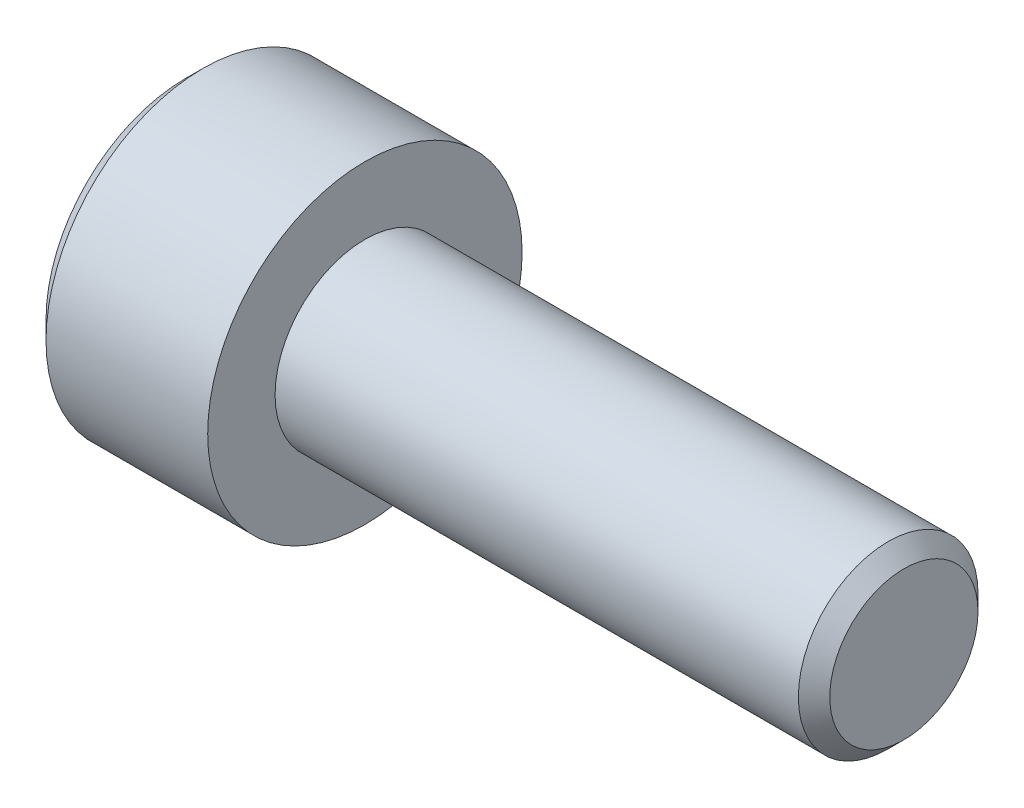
ISO-10303-21;
HEADER;
FILE_DESCRIPTION(('STEP AP214'),'2;1');
FILE_NAME('part.step','',(''),(''),'','','');
FILE_SCHEMA(('AUTOMOTIVE_DESIGN { 1 0 10303 214 1 1 1 1 }'));
ENDSEC;
DATA;
#1=APPLICATION_CONTEXT('core data for automotive mechanical design processes');
#2=APPLICATION_PROTOCOL_DEFINITION('international standard','automotive_design',2000,#1);
#3=PRODUCT_CONTEXT('',#1,'mechanical');
#4=PRODUCT('Part','Part','',(#3));
#5=PRODUCT_RELATED_PRODUCT_CATEGORY('part','',(#4));
#6=PRODUCT_DEFINITION_FORMATION('','',#4);
#7=PRODUCT_DEFINITION_CONTEXT('part definition',#1,'design');
#8=PRODUCT_DEFINITION('design','',#6,#7);
#9=PRODUCT_DEFINITION_SHAPE('','',#8);
#10=(LENGTH_UNIT() NAMED_UNIT(*) SI_UNIT(.MILLI.,.METRE.));
#11=(NAMED_UNIT(*) PLANE_ANGLE_UNIT() SI_UNIT($,.RADIAN.));
#12=(NAMED_UNIT(*) SI_UNIT($,.STERADIAN.) SOLID_ANGLE_UNIT());
#13=UNCERTAINTY_MEASURE_WITH_UNIT(LENGTH_MEASURE(1.E-05),#10,'distance_accuracy_value','');
#14=(GEOMETRIC_REPRESENTATION_CONTEXT(3) GLOBAL_UNCERTAINTY_ASSIGNED_CONTEXT((#13)) GLOBAL_UNIT_ASSIGNED_CONTEXT((#10,
#11,#12)) REPRESENTATION_CONTEXT('',''));
#15=CARTESIAN_POINT('',(0.,0.,0.));
#16=DIRECTION('',(0.,0.,1.));
#17=DIRECTION('',(1.,0.,0.));
#18=AXIS2_PLACEMENT_3D('',#15,#16,#17);
#19=CARTESIAN_POINT('',(4.,0.,0.));
#20=DIRECTION('',(-1.,0.,0.));
#21=DIRECTION('',(0.,0.,1.));
#22=AXIS2_PLACEMENT_3D('',#19,#20,#21);
#23=CYLINDRICAL_SURFACE('',#22,3.5);
#24=CARTESIAN_POINT('',(0.400000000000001,0.,0.));
#25=DIRECTION('',(1.,0.,0.));
#26=DIRECTION('',(0.,0.,-1.));
#27=AXIS2_PLACEMENT_3D('',#24,#25,#26);
#28=CIRCLE('',#27,3.5);
#29=CARTESIAN_POINT('',(0.400000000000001,0.,-3.5));
#30=VERTEX_POINT('',#29);
#31=EDGE_CURVE('E154',#30,#30,#28,.T.);
#32=ORIENTED_EDGE('',*,*,#31,.T.);
#33=EDGE_LOOP('',(#32));
#34=FACE_BOUND('',#33,.T.);
#35=CARTESIAN_POINT('',(4.,0.,0.));
#36=DIRECTION('',(1.,0.,0.));
#37=DIRECTION('',(0.,0.,-1.));
#38=AXIS2_PLACEMENT_3D('',#35,#36,#37);
#39=CIRCLE('',#38,3.5);
#40=CARTESIAN_POINT('',(4.,0.,-3.5));
#41=VERTEX_POINT('',#40);
#42=EDGE_CURVE('E146',#41,#41,#39,.T.);
#43=ORIENTED_EDGE('',*,*,#42,.F.);
#44=EDGE_LOOP('',(#43));
#45=FACE_BOUND('',#44,.T.);
#46=ADVANCED_FACE('F43',(#34,#45),#23,.T.);
#47=CARTESIAN_POINT('',(4.,0.,0.));
#48=DIRECTION('',(1.,0.,0.));
#49=DIRECTION('',(0.,0.,-1.));
#50=AXIS2_PLACEMENT_3D('',#47,#48,#49);
#51=PLANE('',#50);
#52=CARTESIAN_POINT('',(4.,0.,0.));
#53=DIRECTION('',(1.,0.,0.));
#54=DIRECTION('',(0.,0.,-1.));
#55=AXIS2_PLACEMENT_3D('',#52,#53,#54);
#56=CIRCLE('',#55,2.);
#57=CARTESIAN_POINT('',(4.,0.,-2.));
#58=VERTEX_POINT('',#57);
#59=EDGE_CURVE('E133',#58,#58,#56,.T.);
#60=ORIENTED_EDGE('',*,*,#59,.F.);
#61=EDGE_LOOP('',(#60));
#62=FACE_BOUND('',#61,.T.);
#63=ORIENTED_EDGE('',*,*,#42,.T.);
#64=EDGE_LOOP('',(#63));
#65=FACE_BOUND('',#64,.T.);
#66=ADVANCED_FACE('F173',(#62,#65),#51,.T.);
#67=CARTESIAN_POINT('',(0.,0.,0.));
#68=DIRECTION('',(1.,0.,0.));
#69=DIRECTION('',(0.,0.,-1.));
#70=AXIS2_PLACEMENT_3D('',#67,#68,#69);
#71=PLANE('',#70);
#72=CARTESIAN_POINT('',(0.,0.,0.));
#73=DIRECTION('',(1.,0.,0.));
#74=DIRECTION('',(0.,0.,-1.));
#75=AXIS2_PLACEMENT_3D('',#72,#73,#74);
#76=CIRCLE('',#75,3.1);
#77=CARTESIAN_POINT('',(0.,0.,-3.1));
#78=VERTEX_POINT('',#77);
#79=EDGE_CURVE('E157',#78,#78,#76,.F.);
#80=ORIENTED_EDGE('',*,*,#79,.T.);
#81=EDGE_LOOP('',(#80));
#82=FACE_BOUND('',#81,.T.);
#83=DIRECTION('',(0.,-0.866025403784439,0.5));
#84=VECTOR('',#83,1.);
#85=CARTESIAN_POINT('',(0.,0.,-1.73205080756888));
#86=LINE('',#85,#84);
#87=CARTESIAN_POINT('',(0.,0.,-1.73205080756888));
#88=VERTEX_POINT('',#87);
#89=CARTESIAN_POINT('',(0.,-1.5,-0.866025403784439));
#90=VERTEX_POINT('',#89);
#91=EDGE_CURVE('E132',#88,#90,#86,.T.);
#92=ORIENTED_EDGE('',*,*,#91,.F.);
#93=DIRECTION('',(0.,-0.866025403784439,-0.5));
#94=VECTOR('',#93,1.);
#95=CARTESIAN_POINT('',(0.,1.5,-0.866025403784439));
#96=LINE('',#95,#94);
#97=CARTESIAN_POINT('',(0.,1.5,-0.866025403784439));
#98=VERTEX_POINT('',#97);
#99=EDGE_CURVE('E58',#98,#88,#96,.T.);
#100=ORIENTED_EDGE('',*,*,#99,.F.);
#101=DIRECTION('',(0.,0.,-1.));
#102=VECTOR('',#101,1.);
#103=CARTESIAN_POINT('',(0.,1.5,0.866025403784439));
#104=LINE('',#103,#102);
#105=CARTESIAN_POINT('',(0.,1.5,0.866025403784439));
#106=VERTEX_POINT('',#105);
#107=EDGE_CURVE('E142',#106,#98,#104,.T.);
#108=ORIENTED_EDGE('',*,*,#107,.F.);
#109=DIRECTION('',(0.,0.866025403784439,-0.5));
#110=VECTOR('',#109,1.);
#111=CARTESIAN_POINT('',(0.,0.,1.73205080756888));
#112=LINE('',#111,#110);
#113=CARTESIAN_POINT('',(0.,0.,1.73205080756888));
#114=VERTEX_POINT('',#113);
#115=EDGE_CURVE('E140',#114,#106,#112,.T.);
#116=ORIENTED_EDGE('',*,*,#115,.F.);
#117=DIRECTION('',(0.,0.866025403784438,0.5));
#118=VECTOR('',#117,1.);
#119=CARTESIAN_POINT('',(0.,-1.5,0.866025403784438));
#120=LINE('',#119,#118);
#121=CARTESIAN_POINT('',(0.,-1.5,0.866025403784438));
#122=VERTEX_POINT('',#121);
#123=EDGE_CURVE('E106',#122,#114,#120,.T.);
#124=ORIENTED_EDGE('',*,*,#123,.F.);
#125=DIRECTION('',(0.,0.,1.));
#126=VECTOR('',#125,1.);
#127=CARTESIAN_POINT('',(0.,-1.5,-0.866025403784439));
#128=LINE('',#127,#126);
#129=EDGE_CURVE('E136',#90,#122,#128,.T.);
#130=ORIENTED_EDGE('',*,*,#129,.F.);
#131=EDGE_LOOP('',(#92,#100,#108,#116,#124,#130));
#132=FACE_BOUND('',#131,.T.);
#133=ADVANCED_FACE('F181',(#82,#132),#71,.F.);
#134=CARTESIAN_POINT('',(2.2,1.5,-0.866025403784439));
#135=DIRECTION('',(0.,0.5,-0.866025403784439));
#136=DIRECTION('',(0.,0.866025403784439,0.5));
#137=AXIS2_PLACEMENT_3D('',#134,#135,#136);
#138=PLANE('',#137);
#139=ORIENTED_EDGE('',*,*,#99,.T.);
#140=DIRECTION('',(-1.,0.,0.));
#141=VECTOR('',#140,1.);
#142=CARTESIAN_POINT('',(2.2,0.,-1.73205080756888));
#143=LINE('',#142,#141);
#144=CARTESIAN_POINT('',(2.2,0.,-1.73205080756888));
#145=VERTEX_POINT('',#144);
#146=EDGE_CURVE('E88',#145,#88,#143,.T.);
#147=ORIENTED_EDGE('',*,*,#146,.F.);
#148=DIRECTION('',(0.,-0.866025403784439,-0.5));
#149=VECTOR('',#148,1.);
#150=CARTESIAN_POINT('',(2.2,1.5,-0.866025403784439));
#151=LINE('',#150,#149);
#152=CARTESIAN_POINT('',(2.2,1.5,-0.866025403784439));
#153=VERTEX_POINT('',#152);
#154=EDGE_CURVE('E144',#153,#145,#151,.T.);
#155=ORIENTED_EDGE('',*,*,#154,.F.);
#156=DIRECTION('',(-1.,0.,0.));
#157=VECTOR('',#156,1.);
#158=CARTESIAN_POINT('',(2.2,1.5,-0.866025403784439));
#159=LINE('',#158,#157);
#160=EDGE_CURVE('E66',#153,#98,#159,.T.);
#161=ORIENTED_EDGE('',*,*,#160,.T.);
#162=EDGE_LOOP('',(#139,#147,#155,#161));
#163=FACE_BOUND('',#162,.T.);
#164=ADVANCED_FACE('F201',(#163),#138,.F.);
#165=CARTESIAN_POINT('',(2.2,1.5,0.866025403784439));
#166=DIRECTION('',(0.,1.,0.));
#167=DIRECTION('',(0.,0.,1.));
#168=AXIS2_PLACEMENT_3D('',#165,#166,#167);
#169=PLANE('',#168);
#170=ORIENTED_EDGE('',*,*,#107,.T.);
#171=ORIENTED_EDGE('',*,*,#160,.F.);
#172=DIRECTION('',(0.,0.,-1.));
#173=VECTOR('',#172,1.);
#174=CARTESIAN_POINT('',(2.2,1.5,0.866025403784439));
#175=LINE('',#174,#173);
#176=CARTESIAN_POINT('',(2.2,1.5,0.866025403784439));
#177=VERTEX_POINT('',#176);
#178=EDGE_CURVE('E118',#177,#153,#175,.T.);
#179=ORIENTED_EDGE('',*,*,#178,.F.);
#180=DIRECTION('',(-1.,0.,0.));
#181=VECTOR('',#180,1.);
#182=CARTESIAN_POINT('',(2.2,1.5,0.866025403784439));
#183=LINE('',#182,#181);
#184=EDGE_CURVE('E110',#177,#106,#183,.T.);
#185=ORIENTED_EDGE('',*,*,#184,.T.);
#186=EDGE_LOOP('',(#170,#171,#179,#185));
#187=FACE_BOUND('',#186,.T.);
#188=ADVANCED_FACE('F214',(#187),#169,.F.);
#189=CARTESIAN_POINT('',(2.2,0.,1.73205080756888));
#190=DIRECTION('',(0.,0.5,0.866025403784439));
#191=DIRECTION('',(0.,-0.866025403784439,0.5));
#192=AXIS2_PLACEMENT_3D('',#189,#190,#191);
#193=PLANE('',#192);
#194=ORIENTED_EDGE('',*,*,#115,.T.);
#195=ORIENTED_EDGE('',*,*,#184,.F.);
#196=DIRECTION('',(0.,0.866025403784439,-0.5));
#197=VECTOR('',#196,1.);
#198=CARTESIAN_POINT('',(2.2,0.,1.73205080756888));
#199=LINE('',#198,#197);
#200=CARTESIAN_POINT('',(2.2,0.,1.73205080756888));
#201=VERTEX_POINT('',#200);
#202=EDGE_CURVE('E114',#201,#177,#199,.T.);
#203=ORIENTED_EDGE('',*,*,#202,.F.);
#204=DIRECTION('',(-1.,0.,0.));
#205=VECTOR('',#204,1.);
#206=CARTESIAN_POINT('',(2.2,0.,1.73205080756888));
#207=LINE('',#206,#205);
#208=EDGE_CURVE('E99',#201,#114,#207,.T.);
#209=ORIENTED_EDGE('',*,*,#208,.T.);
#210=EDGE_LOOP('',(#194,#195,#203,#209));
#211=FACE_BOUND('',#210,.T.);
#212=ADVANCED_FACE('F115',(#211),#193,.F.);
#213=CARTESIAN_POINT('',(2.2,-1.5,0.866025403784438));
#214=DIRECTION('',(0.,-0.5,0.866025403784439));
#215=DIRECTION('',(0.,-0.866025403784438,-0.5));
#216=AXIS2_PLACEMENT_3D('',#213,#214,#215);
#217=PLANE('',#216);
#218=ORIENTED_EDGE('',*,*,#123,.T.);
#219=ORIENTED_EDGE('',*,*,#208,.F.);
#220=DIRECTION('',(0.,0.866025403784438,0.5));
#221=VECTOR('',#220,1.);
#222=CARTESIAN_POINT('',(2.2,-1.5,0.866025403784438));
#223=LINE('',#222,#221);
#224=CARTESIAN_POINT('',(2.2,-1.5,0.866025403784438));
#225=VERTEX_POINT('',#224);
#226=EDGE_CURVE('E103',#225,#201,#223,.T.);
#227=ORIENTED_EDGE('',*,*,#226,.F.);
#228=DIRECTION('',(-1.,0.,0.));
#229=VECTOR('',#228,1.);
#230=CARTESIAN_POINT('',(2.2,-1.5,0.866025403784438));
#231=LINE('',#230,#229);
#232=EDGE_CURVE('E111',#225,#122,#231,.T.);
#233=ORIENTED_EDGE('',*,*,#232,.T.);
#234=EDGE_LOOP('',(#218,#219,#227,#233));
#235=FACE_BOUND('',#234,.T.);
#236=ADVANCED_FACE('F101',(#235),#217,.F.);
#237=CARTESIAN_POINT('',(2.2,-1.5,-0.866025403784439));
#238=DIRECTION('',(0.,-1.,0.));
#239=DIRECTION('',(0.,0.,-1.));
#240=AXIS2_PLACEMENT_3D('',#237,#238,#239);
#241=PLANE('',#240);
#242=ORIENTED_EDGE('',*,*,#129,.T.);
#243=ORIENTED_EDGE('',*,*,#232,.F.);
#244=DIRECTION('',(0.,0.,1.));
#245=VECTOR('',#244,1.);
#246=CARTESIAN_POINT('',(2.2,-1.5,-0.866025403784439));
#247=LINE('',#246,#245);
#248=CARTESIAN_POINT('',(2.2,-1.5,-0.866025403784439));
#249=VERTEX_POINT('',#248);
#250=EDGE_CURVE('E124',#249,#225,#247,.T.);
#251=ORIENTED_EDGE('',*,*,#250,.F.);
#252=DIRECTION('',(-1.,0.,0.));
#253=VECTOR('',#252,1.);
#254=CARTESIAN_POINT('',(2.2,-1.5,-0.866025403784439));
#255=LINE('',#254,#253);
#256=EDGE_CURVE('E149',#249,#90,#255,.T.);
#257=ORIENTED_EDGE('',*,*,#256,.T.);
#258=EDGE_LOOP('',(#242,#243,#251,#257));
#259=FACE_BOUND('',#258,.T.);
#260=ADVANCED_FACE('F223',(#259),#241,.F.);
#261=CARTESIAN_POINT('',(2.2,0.,-1.73205080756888));
#262=DIRECTION('',(0.,-0.5,-0.866025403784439));
#263=DIRECTION('',(0.,0.866025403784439,-0.5));
#264=AXIS2_PLACEMENT_3D('',#261,#262,#263);
#265=PLANE('',#264);
#266=ORIENTED_EDGE('',*,*,#91,.T.);
#267=ORIENTED_EDGE('',*,*,#256,.F.);
#268=DIRECTION('',(0.,-0.866025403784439,0.5));
#269=VECTOR('',#268,1.);
#270=CARTESIAN_POINT('',(2.2,0.,-1.73205080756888));
#271=LINE('',#270,#269);
#272=EDGE_CURVE('E126',#145,#249,#271,.T.);
#273=ORIENTED_EDGE('',*,*,#272,.F.);
#274=ORIENTED_EDGE('',*,*,#146,.T.);
#275=EDGE_LOOP('',(#266,#267,#273,#274));
#276=FACE_BOUND('',#275,.T.);
#277=ADVANCED_FACE('F194',(#276),#265,.F.);
#278=CARTESIAN_POINT('',(2.2,0.,0.));
#279=DIRECTION('',(-1.,0.,0.));
#280=DIRECTION('',(0.,0.,1.));
#281=AXIS2_PLACEMENT_3D('',#278,#279,#280);
#282=PLANE('',#281);
#283=ORIENTED_EDGE('',*,*,#154,.T.);
#284=ORIENTED_EDGE('',*,*,#272,.T.);
#285=ORIENTED_EDGE('',*,*,#250,.T.);
#286=ORIENTED_EDGE('',*,*,#226,.T.);
#287=ORIENTED_EDGE('',*,*,#202,.T.);
#288=ORIENTED_EDGE('',*,*,#178,.T.);
#289=EDGE_LOOP('',(#283,#284,#285,#286,#287,#288));
#290=FACE_BOUND('',#289,.T.);
#291=ADVANCED_FACE('F121',(#290),#282,.T.);
#292=CARTESIAN_POINT('',(0.400000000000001,0.,0.));
#293=DIRECTION('',(1.,0.,0.));
#294=DIRECTION('',(0.,0.,-1.));
#295=AXIS2_PLACEMENT_3D('',#292,#293,#294);
#296=CONICAL_SURFACE('',#295,3.5,0.78539816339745);
#297=ORIENTED_EDGE('',*,*,#79,.F.);
#298=EDGE_LOOP('',(#297));
#299=FACE_BOUND('',#298,.T.);
#300=ORIENTED_EDGE('',*,*,#31,.F.);
#301=EDGE_LOOP('',(#300));
#302=FACE_BOUND('',#301,.T.);
#303=ADVANCED_FACE('F186',(#299,#302),#296,.T.);
#304=CARTESIAN_POINT('',(16.,0.,0.));
#305=DIRECTION('',(-1.,0.,0.));
#306=DIRECTION('',(0.,0.,1.));
#307=AXIS2_PLACEMENT_3D('',#304,#305,#306);
#308=CYLINDRICAL_SURFACE('',#307,2.);
#309=CARTESIAN_POINT('',(15.65,0.,0.));
#310=DIRECTION('',(1.,0.,0.));
#311=DIRECTION('',(0.,0.,-1.));
#312=AXIS2_PLACEMENT_3D('',#309,#310,#311);
#313=CIRCLE('',#312,2.);
#314=CARTESIAN_POINT('',(15.65,0.,-2.));
#315=VERTEX_POINT('',#314);
#316=EDGE_CURVE('E11',#315,#315,#313,.F.);
#317=ORIENTED_EDGE('',*,*,#316,.T.);
#318=EDGE_LOOP('',(#317));
#319=FACE_BOUND('',#318,.T.);
#320=ORIENTED_EDGE('',*,*,#59,.T.);
#321=EDGE_LOOP('',(#320));
#322=FACE_BOUND('',#321,.T.);
#323=ADVANCED_FACE('F169',(#319,#322),#308,.T.);
#324=CARTESIAN_POINT('',(16.,0.,0.));
#325=DIRECTION('',(1.,0.,0.));
#326=DIRECTION('',(0.,0.,-1.));
#327=AXIS2_PLACEMENT_3D('',#324,#325,#326);
#328=PLANE('',#327);
#329=CARTESIAN_POINT('',(16.,0.,0.));
#330=DIRECTION('',(1.,0.,0.));
#331=DIRECTION('',(0.,0.,-1.));
#332=AXIS2_PLACEMENT_3D('',#329,#330,#331);
#333=CIRCLE('',#332,1.65);
#334=CARTESIAN_POINT('',(16.,0.,-1.65));
#335=VERTEX_POINT('',#334);
#336=EDGE_CURVE('E51',#335,#335,#333,.T.);
#337=ORIENTED_EDGE('',*,*,#336,.T.);
#338=EDGE_LOOP('',(#337));
#339=FACE_BOUND('',#338,.T.);
#340=ADVANCED_FACE('F162',(#339),#328,.T.);
#341=CARTESIAN_POINT('',(16.,0.,0.));
#342=DIRECTION('',(-1.,0.,0.));
#343=DIRECTION('',(0.,0.,1.));
#344=AXIS2_PLACEMENT_3D('',#341,#342,#343);
#345=CONICAL_SURFACE('',#344,1.65,0.785398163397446);
#346=ORIENTED_EDGE('',*,*,#316,.F.);
#347=EDGE_LOOP('',(#346));
#348=FACE_BOUND('',#347,.T.);
#349=ORIENTED_EDGE('',*,*,#336,.F.);
#350=EDGE_LOOP('',(#349));
#351=FACE_BOUND('',#350,.T.);
#352=ADVANCED_FACE('F45',(#348,#351),#345,.T.);
#353=CLOSED_SHELL('',(#46,#66,#133,#164,#188,#212,#236,#260,#277,#291,#303,#323,#340,#352));
#354=MANIFOLD_SOLID_BREP('B2',#353);
#355=ADVANCED_BREP_SHAPE_REPRESENTATION('',(#18,#354),#14);
#356=SHAPE_DEFINITION_REPRESENTATION(#9,#355);
ENDSEC;
END-ISO-10303-21;
